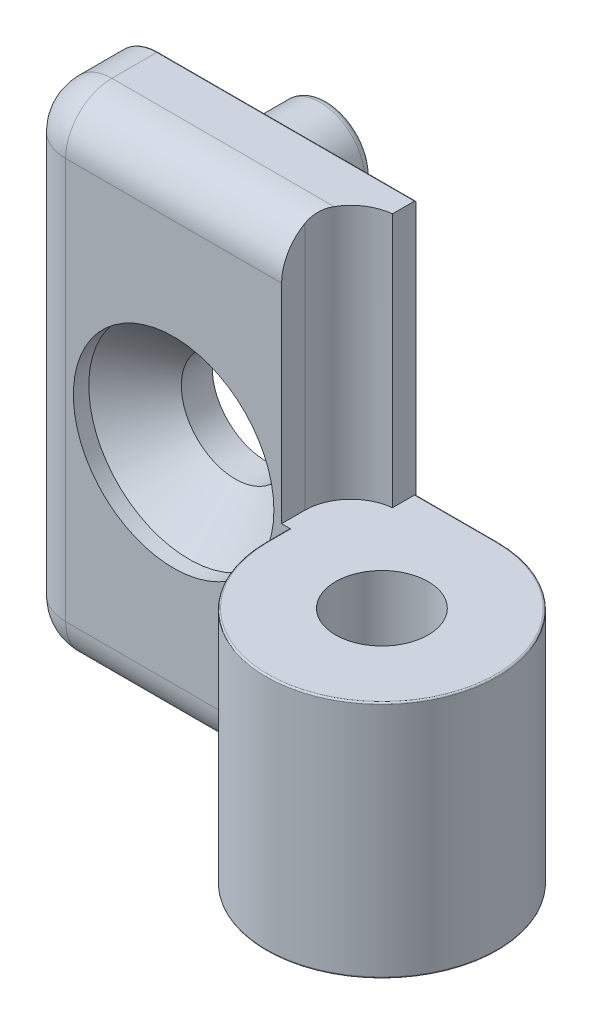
from build123d import *

# Parameters (mm, degrees)
EXTRUDE_1_DEPTH     = 15.5
SKETCH_10_R         = 3
CUT_EXTRUDE_2_DEPTH = 13.5
EXTRUDE_2_DEPTH     = 32
CUT_EXTRUDE_3_DEPTH = 16.5
SKETCH_12_R         = 2.9
EXTRUDE_3_DEPTH     = 4
FILLET_1_R          = 0.5
FILLET_2_R          = 3
SKETCH_15_R         = 2
CUT_EXTRUDE_4_DEPTH = 7.5
FILLET_3_R          = 0.1


with BuildPart() as part:
    # Sketch 1 → Extrude 1 (new body)
    with BuildSketch(Plane(origin=(0, 0, 0), x_dir=(1, 0, 0), z_dir=(0, 1, 0))):
        with BuildLine():
            Line((-7.6, 1.5), (-7.5, 1.5))
            Line((-7.5, 1.5), (-7.5, 0))
            ThreePointArc((-7.5, 0), (5.303300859, -5.303300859), (0, 7.5))
            Line((0, 7.5), (-7.6, 7.5))
            Line((-7.6, 7.5), (-7.6, 1.5))
        make_face()
    extrude(amount=EXTRUDE_1_DEPTH)

    # Sketch 10 → Cut-Extrude 2 (cut)
    with BuildSketch(Plane(origin=(0, 15.5, 0), x_dir=(1, 0, 0), z_dir=(0, 1, 0))):
        with Locations(Location((0, 0, 0), (0, 0, 270))):
            Circle(SKETCH_10_R)
    extrude(amount=-CUT_EXTRUDE_2_DEPTH, mode=Mode.SUBTRACT)

    # Sketch 2 → Extrude 2 (add)
    with BuildSketch(Plane.XZ):
        with BuildLine():
            Line((-25, -4.5), (-25, -7.5))
            Line((-25, -7.5), (-5.3, -7.5))
            Line((-5.3, -7.5), (-5.3, -1.5))
            Line((-5.3, -1.5), (-22, -1.5))
            ThreePointArc((-22, -1.5), (-24.121320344, -2.378679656), (-25, -4.5))
        make_face()
    extrude(amount=-EXTRUDE_2_DEPTH)

    # Sketch 11 → Cut-Extrude 3 (cut)
    with BuildSketch(Plane(origin=(0, 32, 0), x_dir=(1, 0, 0), z_dir=(0, 1, 0))):
        with BuildLine():
            Line((-8, 3), (-8, 0))
            Line((-8, 0), (-5, 0))
            ThreePointArc((-5, 0), (-2.878679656, 5.121320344), (-8, 3))
        make_face()
    extrude(amount=-CUT_EXTRUDE_3_DEPTH, mode=Mode.SUBTRACT)

    # Sketch 12 → Extrude 3 (add)
    with BuildSketch(Plane(origin=(0, 0, -7.5), x_dir=(-1, 0, 0), z_dir=(0, 0, -1))):
        with Locations(Location((15, 28, 0), (0, 0, 180))):
            Circle(SKETCH_12_R)
        with Locations(Location((15, 4, 0), (0, 0, 180))):
            Circle(SKETCH_12_R)
    extrude(amount=EXTRUDE_3_DEPTH)

    # Fillet 1
    fillet_1_edges = [part.edges().sort_by_distance(p)[0] for p in [
        (-17.9, 28, -11.5),
        (-17.9, 4, -11.5),
    ]]
    fillet(fillet_1_edges, radius=FILLET_1_R)

    # Sketch 13 → Hole Wizard 1 (revolve, cut)
    with BuildSketch(Plane(origin=(-15, 16, -1.5), x_dir=(0, -1, 0), z_dir=(1, 0, 0))):
        Polygon((0, 0), (0, 10), (3.5, 10), (3.5, 4), (6.5, 1), (6.5, 0), align=None)
    revolve(axis=Axis((-15, 16, 4.85), (0, 0, -1)), mode=Mode.SUBTRACT)

    # Fillet 2
    fillet_2_edges = [part.edges().sort_by_distance(p)[0] for p in [
        (-25, 0, -6),
        (-25, 32, -6),
        (-24.121320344, 0, -2.378679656),
        (-24.121320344, 32, -2.378679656),
        (-14.75, 0, -1.5),
        (-15, 32, -1.5),
    ]]
    fillet(fillet_2_edges, radius=FILLET_2_R)

    # Sketch 15 → Cut-Extrude 4 (cut)
    with BuildSketch(Plane(origin=(0, 0, -11.5), x_dir=(-1, 0, 0), z_dir=(0, 0, -1))):
        with Locations((15, 28)):
            Circle(SKETCH_15_R)
        with Locations((15, 4)):
            Circle(SKETCH_15_R)
    extrude(amount=-CUT_EXTRUDE_4_DEPTH, mode=Mode.SUBTRACT)

    # Fillet 3
    fillet_3_edges = [part.edges().sort_by_distance(p)[0] for p in [
        (-7.5, 15.5, -0.75),
        (5.303300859, 15.5, 5.303300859),
        (-7.5, 0, -2.25),
        (-11, 0, -7.5),
        (5.303300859, 0, 5.303300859),
        (-2.65, 15.5, -7.5),
        (-25, 16, -7.5),
        (-13.65, 32, -7.5),
        (-24.121320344, 31.121320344, -7.5),
        (-24.121320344, 0.878679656, -7.5),
    ]]
    fillet(fillet_3_edges, radius=FILLET_3_R)


solid = part.part
